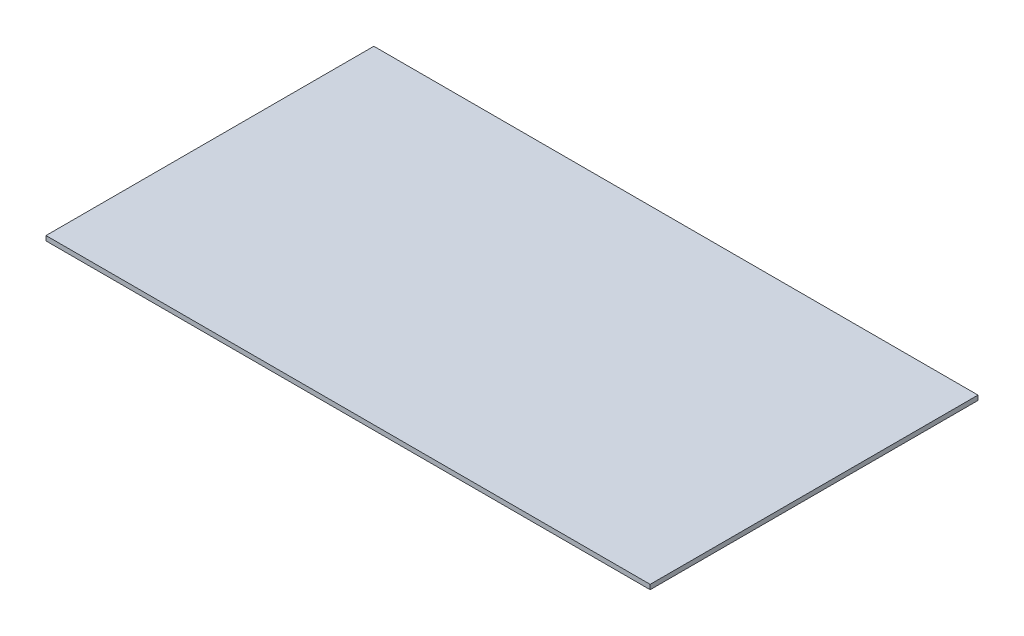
from build123d import *

# Parameters (mm, degrees)
SKETCH1_W          = 645
SKETCH1_H          = 5
BASE_EXTRUDE_DEPTH = 350


with BuildPart() as part:
    # Sketch1 → Base-Extrude (new body)
    with BuildSketch(Plane.XY):
        with Locations((0, -57.5)):
            Rectangle(SKETCH1_W, SKETCH1_H)
    extrude(amount=BASE_EXTRUDE_DEPTH)


solid = part.part
